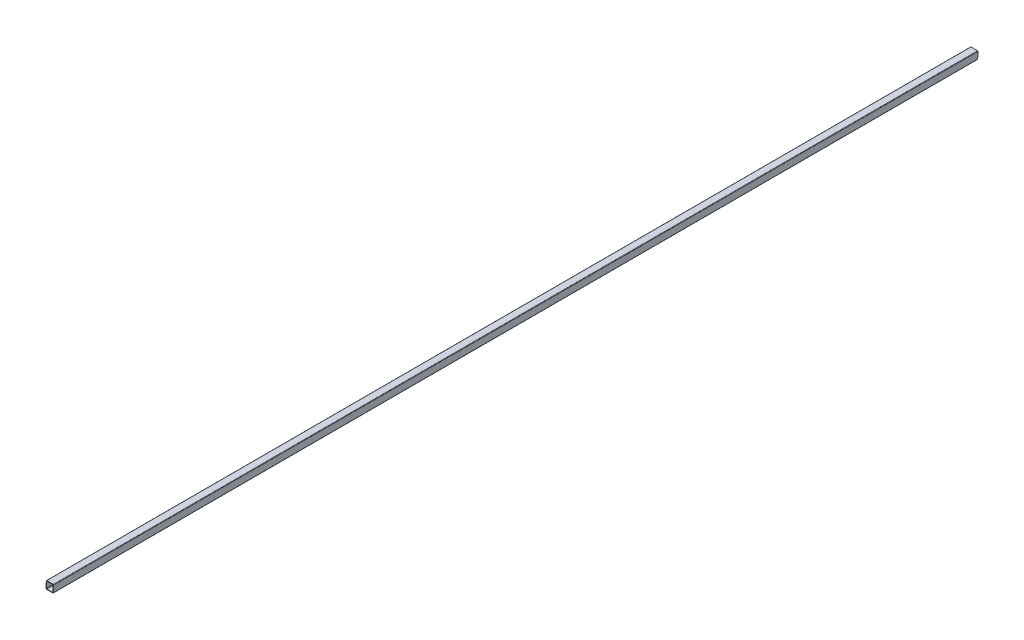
from build123d import *

# Parameters (mm, degrees)
ESQUISSE1_W             = 80
ESQUISSE1_H             = 80
ESQUISSE1_W_2           = 70
ESQUISSE1_H_2           = 70
BOSS_EXTRU_1_DEPTH      = 10200
ENL_V_MAT_EXTRU_1_DEPTH = 10201.392149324
CONG_1_R                = 5
ENL_V_MAT_EXTRU_2_DEPTH = 10201.392149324


with BuildPart() as part:
    # Esquisse1 → Boss.-Extru.1 (new body)
    with BuildSketch(Plane.XY):
        Rectangle(ESQUISSE1_W, ESQUISSE1_H)
        Rectangle(ESQUISSE1_W_2, ESQUISSE1_H_2, mode=Mode.SUBTRACT)
    extrude(amount=BOSS_EXTRU_1_DEPTH)

    # Esquisse2 → Enl_v. mat.-Extru.1 (cut, through all)
    with BuildSketch(Plane(origin=(40, 0, 0), x_dir=(0, 0, -1), z_dir=(1, 0, 0))):
        Polygon((0, 40), (-5.39594127, -67.919022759), (70.302798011, -76.625182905), (74.961637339, 49.163478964), align=None)
    extrude(amount=-ENL_V_MAT_EXTRU_1_DEPTH, mode=Mode.SUBTRACT)

    # Cong_1
    cong_1_edges = [part.edges().sort_by_distance(p)[0] for p in [
        (-35, 35, 5100.124999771),
        (-35, -35, 5101.874996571),
        (35, -35, 5101.874996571),
        (35, 35, 5100.124999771),
        (-40, 40, 5100),
        (40, 40, 5100),
        (40, -40, 5101.999996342),
        (-40, -40, 5101.999996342),
    ]]
    fillet(cong_1_edges, radius=CONG_1_R)

    # Esquisse3 → Enl_v. mat.-Extru.2 (cut, through all)
    with BuildSketch(Plane(origin=(40, 0, 0), x_dir=(0, 0, -1), z_dir=(1, 0, 0))):
        Polygon((-10012.49, 40), (-10017.816601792, -66.532230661), (-10226.996042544, -66.532230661), (-10226.996042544, 77.733134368), (-10012.49, 77.733134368), align=None)
    extrude(amount=-ENL_V_MAT_EXTRU_2_DEPTH, mode=Mode.SUBTRACT)


solid = part.part
